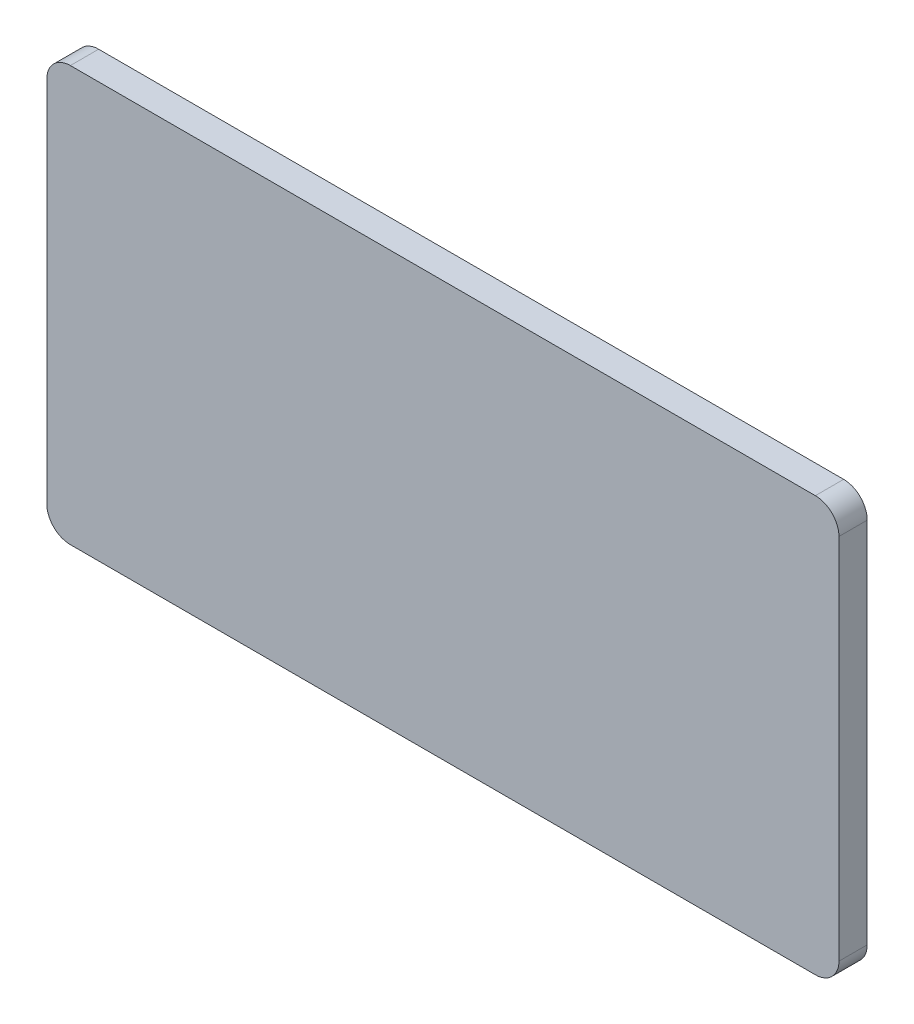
ISO-10303-21;
HEADER;
FILE_DESCRIPTION(('STEP AP214'),'2;1');
FILE_NAME('part.step','',(''),(''),'','','');
FILE_SCHEMA(('AUTOMOTIVE_DESIGN { 1 0 10303 214 1 1 1 1 }'));
ENDSEC;
DATA;
#1=APPLICATION_CONTEXT('core data for automotive mechanical design processes');
#2=APPLICATION_PROTOCOL_DEFINITION('international standard','automotive_design',2000,#1);
#3=PRODUCT_CONTEXT('',#1,'mechanical');
#4=PRODUCT('Part','Part','',(#3));
#5=PRODUCT_RELATED_PRODUCT_CATEGORY('part','',(#4));
#6=PRODUCT_DEFINITION_FORMATION('','',#4);
#7=PRODUCT_DEFINITION_CONTEXT('part definition',#1,'design');
#8=PRODUCT_DEFINITION('design','',#6,#7);
#9=PRODUCT_DEFINITION_SHAPE('','',#8);
#10=(LENGTH_UNIT() NAMED_UNIT(*) SI_UNIT(.MILLI.,.METRE.));
#11=(NAMED_UNIT(*) PLANE_ANGLE_UNIT() SI_UNIT($,.RADIAN.));
#12=(NAMED_UNIT(*) SI_UNIT($,.STERADIAN.) SOLID_ANGLE_UNIT());
#13=UNCERTAINTY_MEASURE_WITH_UNIT(LENGTH_MEASURE(1.E-05),#10,'distance_accuracy_value','');
#14=(GEOMETRIC_REPRESENTATION_CONTEXT(3) GLOBAL_UNCERTAINTY_ASSIGNED_CONTEXT((#13)) GLOBAL_UNIT_ASSIGNED_CONTEXT((#10,
#11,#12)) REPRESENTATION_CONTEXT('',''));
#15=CARTESIAN_POINT('',(0.,0.,0.));
#16=DIRECTION('',(0.,0.,1.));
#17=DIRECTION('',(1.,0.,0.));
#18=AXIS2_PLACEMENT_3D('',#15,#16,#17);
#19=CARTESIAN_POINT('',(-39.5,104.5,0.));
#20=DIRECTION('',(0.,0.,-1.));
#21=DIRECTION('',(-1.,0.,0.));
#22=AXIS2_PLACEMENT_3D('',#19,#20,#21);
#23=PLANE('',#22);
#24=CARTESIAN_POINT('',(-39.5,104.5,0.));
#25=DIRECTION('',(0.,0.,1.));
#26=DIRECTION('',(-1.,0.,0.));
#27=AXIS2_PLACEMENT_3D('',#24,#25,#26);
#28=CIRCLE('',#27,2.5);
#29=CARTESIAN_POINT('',(-39.5,107.,0.));
#30=VERTEX_POINT('',#29);
#31=CARTESIAN_POINT('',(-42.,104.5,0.));
#32=VERTEX_POINT('',#31);
#33=EDGE_CURVE('E146',#30,#32,#28,.T.);
#34=ORIENTED_EDGE('',*,*,#33,.F.);
#35=DIRECTION('',(-1.,0.,0.));
#36=VECTOR('',#35,1.);
#37=CARTESIAN_POINT('',(-39.5,107.,0.));
#38=LINE('',#37,#36);
#39=CARTESIAN_POINT('',(39.5,107.,0.));
#40=VERTEX_POINT('',#39);
#41=EDGE_CURVE('E94',#40,#30,#38,.T.);
#42=ORIENTED_EDGE('',*,*,#41,.F.);
#43=CARTESIAN_POINT('',(39.5,104.5,0.));
#44=DIRECTION('',(0.,0.,1.));
#45=DIRECTION('',(1.,0.,0.));
#46=AXIS2_PLACEMENT_3D('',#43,#44,#45);
#47=CIRCLE('',#46,2.5);
#48=CARTESIAN_POINT('',(42.,104.5,0.));
#49=VERTEX_POINT('',#48);
#50=EDGE_CURVE('E159',#49,#40,#47,.T.);
#51=ORIENTED_EDGE('',*,*,#50,.F.);
#52=DIRECTION('',(0.,1.,0.));
#53=VECTOR('',#52,1.);
#54=CARTESIAN_POINT('',(42.,104.5,0.));
#55=LINE('',#54,#53);
#56=CARTESIAN_POINT('',(42.,65.5,0.));
#57=VERTEX_POINT('',#56);
#58=EDGE_CURVE('E134',#57,#49,#55,.T.);
#59=ORIENTED_EDGE('',*,*,#58,.F.);
#60=CARTESIAN_POINT('',(39.5,65.5,0.));
#61=DIRECTION('',(0.,0.,1.));
#62=DIRECTION('',(1.,0.,0.));
#63=AXIS2_PLACEMENT_3D('',#60,#61,#62);
#64=CIRCLE('',#63,2.5);
#65=CARTESIAN_POINT('',(39.5,63.,0.));
#66=VERTEX_POINT('',#65);
#67=EDGE_CURVE('E156',#66,#57,#64,.T.);
#68=ORIENTED_EDGE('',*,*,#67,.F.);
#69=DIRECTION('',(1.,0.,0.));
#70=VECTOR('',#69,1.);
#71=CARTESIAN_POINT('',(-39.5,63.,0.));
#72=LINE('',#71,#70);
#73=CARTESIAN_POINT('',(-39.5,63.,0.));
#74=VERTEX_POINT('',#73);
#75=EDGE_CURVE('E154',#74,#66,#72,.T.);
#76=ORIENTED_EDGE('',*,*,#75,.F.);
#77=CARTESIAN_POINT('',(-39.5,65.5,0.));
#78=DIRECTION('',(0.,0.,1.));
#79=DIRECTION('',(1.,0.,0.));
#80=AXIS2_PLACEMENT_3D('',#77,#78,#79);
#81=CIRCLE('',#80,2.5);
#82=CARTESIAN_POINT('',(-42.,65.5,0.));
#83=VERTEX_POINT('',#82);
#84=EDGE_CURVE('E152',#83,#74,#81,.T.);
#85=ORIENTED_EDGE('',*,*,#84,.F.);
#86=DIRECTION('',(0.,-1.,0.));
#87=VECTOR('',#86,1.);
#88=CARTESIAN_POINT('',(-42.,104.5,0.));
#89=LINE('',#88,#87);
#90=EDGE_CURVE('E149',#32,#83,#89,.T.);
#91=ORIENTED_EDGE('',*,*,#90,.F.);
#92=EDGE_LOOP('',(#34,#42,#51,#59,#68,#76,#85,#91));
#93=FACE_BOUND('',#92,.T.);
#94=DIRECTION('',(1.,0.,0.));
#95=VECTOR('',#94,1.);
#96=CARTESIAN_POINT('',(33.9,100.4,0.));
#97=LINE('',#96,#95);
#98=CARTESIAN_POINT('',(-33.9,100.4,0.));
#99=VERTEX_POINT('',#98);
#100=CARTESIAN_POINT('',(33.9,100.4,0.));
#101=VERTEX_POINT('',#100);
#102=EDGE_CURVE('E234',#99,#101,#97,.T.);
#103=ORIENTED_EDGE('',*,*,#102,.F.);
#104=CARTESIAN_POINT('',(-33.9,97.9,0.));
#105=DIRECTION('',(0.,0.,-1.));
#106=DIRECTION('',(1.,0.,0.));
#107=AXIS2_PLACEMENT_3D('',#104,#105,#106);
#108=CIRCLE('',#107,2.5);
#109=CARTESIAN_POINT('',(-36.4,97.9,0.));
#110=VERTEX_POINT('',#109);
#111=EDGE_CURVE('E237',#110,#99,#108,.T.);
#112=ORIENTED_EDGE('',*,*,#111,.F.);
#113=DIRECTION('',(0.,1.,0.));
#114=VECTOR('',#113,1.);
#115=CARTESIAN_POINT('',(-36.4,97.9,0.));
#116=LINE('',#115,#114);
#117=CARTESIAN_POINT('',(-36.4,76.9,0.));
#118=VERTEX_POINT('',#117);
#119=EDGE_CURVE('E217',#118,#110,#116,.T.);
#120=ORIENTED_EDGE('',*,*,#119,.F.);
#121=CARTESIAN_POINT('',(-33.9,76.9,0.));
#122=DIRECTION('',(0.,0.,-1.));
#123=DIRECTION('',(-1.,0.,0.));
#124=AXIS2_PLACEMENT_3D('',#121,#122,#123);
#125=CIRCLE('',#124,2.5);
#126=CARTESIAN_POINT('',(-33.9,74.4,0.));
#127=VERTEX_POINT('',#126);
#128=EDGE_CURVE('E220',#127,#118,#125,.T.);
#129=ORIENTED_EDGE('',*,*,#128,.F.);
#130=DIRECTION('',(-1.,0.,0.));
#131=VECTOR('',#130,1.);
#132=CARTESIAN_POINT('',(33.9,74.4,0.));
#133=LINE('',#132,#131);
#134=CARTESIAN_POINT('',(33.9,74.4,0.));
#135=VERTEX_POINT('',#134);
#136=EDGE_CURVE('E222',#135,#127,#133,.T.);
#137=ORIENTED_EDGE('',*,*,#136,.F.);
#138=CARTESIAN_POINT('',(33.9,76.9,0.));
#139=DIRECTION('',(0.,0.,-1.));
#140=DIRECTION('',(-1.,0.,0.));
#141=AXIS2_PLACEMENT_3D('',#138,#139,#140);
#142=CIRCLE('',#141,2.5);
#143=CARTESIAN_POINT('',(36.4,76.9,0.));
#144=VERTEX_POINT('',#143);
#145=EDGE_CURVE('E225',#144,#135,#142,.T.);
#146=ORIENTED_EDGE('',*,*,#145,.F.);
#147=DIRECTION('',(0.,-1.,0.));
#148=VECTOR('',#147,1.);
#149=CARTESIAN_POINT('',(36.4,97.9,0.));
#150=LINE('',#149,#148);
#151=CARTESIAN_POINT('',(36.4,97.9,0.));
#152=VERTEX_POINT('',#151);
#153=EDGE_CURVE('E228',#152,#144,#150,.T.);
#154=ORIENTED_EDGE('',*,*,#153,.F.);
#155=CARTESIAN_POINT('',(33.9,97.9,0.));
#156=DIRECTION('',(0.,0.,-1.));
#157=DIRECTION('',(-1.,0.,0.));
#158=AXIS2_PLACEMENT_3D('',#155,#156,#157);
#159=CIRCLE('',#158,2.5);
#160=EDGE_CURVE('E231',#101,#152,#159,.T.);
#161=ORIENTED_EDGE('',*,*,#160,.F.);
#162=EDGE_LOOP('',(#103,#112,#120,#129,#137,#146,#154,#161));
#163=FACE_BOUND('',#162,.T.);
#164=ADVANCED_FACE('F37',(#93,#163),#23,.T.);
#165=CARTESIAN_POINT('',(-39.5,104.5,3.));
#166=DIRECTION('',(0.,0.,-1.));
#167=DIRECTION('',(-1.,0.,0.));
#168=AXIS2_PLACEMENT_3D('',#165,#166,#167);
#169=CYLINDRICAL_SURFACE('',#168,2.5);
#170=ORIENTED_EDGE('',*,*,#33,.T.);
#171=DIRECTION('',(0.,0.,-1.));
#172=VECTOR('',#171,1.);
#173=CARTESIAN_POINT('',(-42.,104.5,3.));
#174=LINE('',#173,#172);
#175=CARTESIAN_POINT('',(-42.,104.5,3.));
#176=VERTEX_POINT('',#175);
#177=EDGE_CURVE('E11',#176,#32,#174,.T.);
#178=ORIENTED_EDGE('',*,*,#177,.F.);
#179=CARTESIAN_POINT('',(-39.5,104.5,3.));
#180=DIRECTION('',(0.,0.,1.));
#181=DIRECTION('',(-1.,0.,0.));
#182=AXIS2_PLACEMENT_3D('',#179,#180,#181);
#183=CIRCLE('',#182,2.5);
#184=CARTESIAN_POINT('',(-39.5,107.,3.));
#185=VERTEX_POINT('',#184);
#186=EDGE_CURVE('E162',#185,#176,#183,.T.);
#187=ORIENTED_EDGE('',*,*,#186,.F.);
#188=DIRECTION('',(0.,0.,-1.));
#189=VECTOR('',#188,1.);
#190=CARTESIAN_POINT('',(-39.5,107.,3.));
#191=LINE('',#190,#189);
#192=EDGE_CURVE('E142',#185,#30,#191,.T.);
#193=ORIENTED_EDGE('',*,*,#192,.T.);
#194=EDGE_LOOP('',(#170,#178,#187,#193));
#195=FACE_BOUND('',#194,.T.);
#196=ADVANCED_FACE('F39',(#195),#169,.T.);
#197=CARTESIAN_POINT('',(-42.,104.5,3.));
#198=DIRECTION('',(1.,0.,0.));
#199=DIRECTION('',(0.,1.,0.));
#200=AXIS2_PLACEMENT_3D('',#197,#198,#199);
#201=PLANE('',#200);
#202=ORIENTED_EDGE('',*,*,#90,.T.);
#203=DIRECTION('',(0.,0.,-1.));
#204=VECTOR('',#203,1.);
#205=CARTESIAN_POINT('',(-42.,65.5,3.));
#206=LINE('',#205,#204);
#207=CARTESIAN_POINT('',(-42.,65.5,3.));
#208=VERTEX_POINT('',#207);
#209=EDGE_CURVE('E45',#208,#83,#206,.T.);
#210=ORIENTED_EDGE('',*,*,#209,.F.);
#211=DIRECTION('',(0.,-1.,0.));
#212=VECTOR('',#211,1.);
#213=CARTESIAN_POINT('',(-42.,104.5,3.));
#214=LINE('',#213,#212);
#215=EDGE_CURVE('E102',#176,#208,#214,.T.);
#216=ORIENTED_EDGE('',*,*,#215,.F.);
#217=ORIENTED_EDGE('',*,*,#177,.T.);
#218=EDGE_LOOP('',(#202,#210,#216,#217));
#219=FACE_BOUND('',#218,.T.);
#220=ADVANCED_FACE('F339',(#219),#201,.F.);
#221=CARTESIAN_POINT('',(-39.5,65.5,3.));
#222=DIRECTION('',(0.,0.,-1.));
#223=DIRECTION('',(-1.,0.,0.));
#224=AXIS2_PLACEMENT_3D('',#221,#222,#223);
#225=CYLINDRICAL_SURFACE('',#224,2.5);
#226=ORIENTED_EDGE('',*,*,#84,.T.);
#227=DIRECTION('',(0.,0.,-1.));
#228=VECTOR('',#227,1.);
#229=CARTESIAN_POINT('',(-39.5,63.,3.));
#230=LINE('',#229,#228);
#231=CARTESIAN_POINT('',(-39.5,63.,3.));
#232=VERTEX_POINT('',#231);
#233=EDGE_CURVE('E169',#232,#74,#230,.T.);
#234=ORIENTED_EDGE('',*,*,#233,.F.);
#235=CARTESIAN_POINT('',(-39.5,65.5,3.));
#236=DIRECTION('',(0.,0.,1.));
#237=DIRECTION('',(1.,0.,0.));
#238=AXIS2_PLACEMENT_3D('',#235,#236,#237);
#239=CIRCLE('',#238,2.5);
#240=EDGE_CURVE('E177',#208,#232,#239,.T.);
#241=ORIENTED_EDGE('',*,*,#240,.F.);
#242=ORIENTED_EDGE('',*,*,#209,.T.);
#243=EDGE_LOOP('',(#226,#234,#241,#242));
#244=FACE_BOUND('',#243,.T.);
#245=ADVANCED_FACE('F175',(#244),#225,.T.);
#246=CARTESIAN_POINT('',(-39.5,63.,3.));
#247=DIRECTION('',(0.,1.,0.));
#248=DIRECTION('',(0.,0.,1.));
#249=AXIS2_PLACEMENT_3D('',#246,#247,#248);
#250=PLANE('',#249);
#251=ORIENTED_EDGE('',*,*,#75,.T.);
#252=DIRECTION('',(0.,0.,-1.));
#253=VECTOR('',#252,1.);
#254=CARTESIAN_POINT('',(39.5,63.,3.));
#255=LINE('',#254,#253);
#256=CARTESIAN_POINT('',(39.5,63.,3.));
#257=VERTEX_POINT('',#256);
#258=EDGE_CURVE('E166',#257,#66,#255,.T.);
#259=ORIENTED_EDGE('',*,*,#258,.F.);
#260=DIRECTION('',(1.,0.,0.));
#261=VECTOR('',#260,1.);
#262=CARTESIAN_POINT('',(-39.5,63.,3.));
#263=LINE('',#262,#261);
#264=EDGE_CURVE('E189',#232,#257,#263,.T.);
#265=ORIENTED_EDGE('',*,*,#264,.F.);
#266=ORIENTED_EDGE('',*,*,#233,.T.);
#267=EDGE_LOOP('',(#251,#259,#265,#266));
#268=FACE_BOUND('',#267,.T.);
#269=ADVANCED_FACE('F185',(#268),#250,.F.);
#270=CARTESIAN_POINT('',(39.5,65.5,3.));
#271=DIRECTION('',(0.,0.,-1.));
#272=DIRECTION('',(-1.,0.,0.));
#273=AXIS2_PLACEMENT_3D('',#270,#271,#272);
#274=CYLINDRICAL_SURFACE('',#273,2.5);
#275=ORIENTED_EDGE('',*,*,#67,.T.);
#276=DIRECTION('',(0.,0.,-1.));
#277=VECTOR('',#276,1.);
#278=CARTESIAN_POINT('',(42.,65.5,3.));
#279=LINE('',#278,#277);
#280=CARTESIAN_POINT('',(42.,65.5,3.));
#281=VERTEX_POINT('',#280);
#282=EDGE_CURVE('E137',#281,#57,#279,.T.);
#283=ORIENTED_EDGE('',*,*,#282,.F.);
#284=CARTESIAN_POINT('',(39.5,65.5,3.));
#285=DIRECTION('',(0.,0.,1.));
#286=DIRECTION('',(1.,0.,0.));
#287=AXIS2_PLACEMENT_3D('',#284,#285,#286);
#288=CIRCLE('',#287,2.5);
#289=EDGE_CURVE('E125',#257,#281,#288,.T.);
#290=ORIENTED_EDGE('',*,*,#289,.F.);
#291=ORIENTED_EDGE('',*,*,#258,.T.);
#292=EDGE_LOOP('',(#275,#283,#290,#291));
#293=FACE_BOUND('',#292,.T.);
#294=ADVANCED_FACE('F188',(#293),#274,.T.);
#295=CARTESIAN_POINT('',(42.,104.5,3.));
#296=DIRECTION('',(-1.,0.,0.));
#297=DIRECTION('',(0.,-1.,0.));
#298=AXIS2_PLACEMENT_3D('',#295,#296,#297);
#299=PLANE('',#298);
#300=ORIENTED_EDGE('',*,*,#58,.T.);
#301=DIRECTION('',(0.,0.,-1.));
#302=VECTOR('',#301,1.);
#303=CARTESIAN_POINT('',(42.,104.5,3.));
#304=LINE('',#303,#302);
#305=CARTESIAN_POINT('',(42.,104.5,3.));
#306=VERTEX_POINT('',#305);
#307=EDGE_CURVE('E131',#306,#49,#304,.T.);
#308=ORIENTED_EDGE('',*,*,#307,.F.);
#309=DIRECTION('',(0.,1.,0.));
#310=VECTOR('',#309,1.);
#311=CARTESIAN_POINT('',(42.,104.5,3.));
#312=LINE('',#311,#310);
#313=EDGE_CURVE('E118',#281,#306,#312,.T.);
#314=ORIENTED_EDGE('',*,*,#313,.F.);
#315=ORIENTED_EDGE('',*,*,#282,.T.);
#316=EDGE_LOOP('',(#300,#308,#314,#315));
#317=FACE_BOUND('',#316,.T.);
#318=ADVANCED_FACE('F132',(#317),#299,.F.);
#319=CARTESIAN_POINT('',(39.5,104.5,3.));
#320=DIRECTION('',(0.,0.,-1.));
#321=DIRECTION('',(-1.,0.,0.));
#322=AXIS2_PLACEMENT_3D('',#319,#320,#321);
#323=CYLINDRICAL_SURFACE('',#322,2.5);
#324=ORIENTED_EDGE('',*,*,#50,.T.);
#325=DIRECTION('',(0.,0.,-1.));
#326=VECTOR('',#325,1.);
#327=CARTESIAN_POINT('',(39.5,107.,3.));
#328=LINE('',#327,#326);
#329=CARTESIAN_POINT('',(39.5,107.,3.));
#330=VERTEX_POINT('',#329);
#331=EDGE_CURVE('E138',#330,#40,#328,.T.);
#332=ORIENTED_EDGE('',*,*,#331,.F.);
#333=CARTESIAN_POINT('',(39.5,104.5,3.));
#334=DIRECTION('',(0.,0.,1.));
#335=DIRECTION('',(1.,0.,0.));
#336=AXIS2_PLACEMENT_3D('',#333,#334,#335);
#337=CIRCLE('',#336,2.5);
#338=EDGE_CURVE('E122',#306,#330,#337,.T.);
#339=ORIENTED_EDGE('',*,*,#338,.F.);
#340=ORIENTED_EDGE('',*,*,#307,.T.);
#341=EDGE_LOOP('',(#324,#332,#339,#340));
#342=FACE_BOUND('',#341,.T.);
#343=ADVANCED_FACE('F140',(#342),#323,.T.);
#344=CARTESIAN_POINT('',(-39.5,107.,3.));
#345=DIRECTION('',(0.,-1.,0.));
#346=DIRECTION('',(0.,0.,-1.));
#347=AXIS2_PLACEMENT_3D('',#344,#345,#346);
#348=PLANE('',#347);
#349=ORIENTED_EDGE('',*,*,#41,.T.);
#350=ORIENTED_EDGE('',*,*,#192,.F.);
#351=DIRECTION('',(-1.,0.,0.));
#352=VECTOR('',#351,1.);
#353=CARTESIAN_POINT('',(-39.5,107.,3.));
#354=LINE('',#353,#352);
#355=EDGE_CURVE('E61',#330,#185,#354,.T.);
#356=ORIENTED_EDGE('',*,*,#355,.F.);
#357=ORIENTED_EDGE('',*,*,#331,.T.);
#358=EDGE_LOOP('',(#349,#350,#356,#357));
#359=FACE_BOUND('',#358,.T.);
#360=ADVANCED_FACE('F344',(#359),#348,.F.);
#361=CARTESIAN_POINT('',(-39.5,104.5,3.));
#362=DIRECTION('',(0.,0.,-1.));
#363=DIRECTION('',(-1.,0.,0.));
#364=AXIS2_PLACEMENT_3D('',#361,#362,#363);
#365=PLANE('',#364);
#366=ORIENTED_EDGE('',*,*,#186,.T.);
#367=ORIENTED_EDGE('',*,*,#215,.T.);
#368=ORIENTED_EDGE('',*,*,#240,.T.);
#369=ORIENTED_EDGE('',*,*,#264,.T.);
#370=ORIENTED_EDGE('',*,*,#289,.T.);
#371=ORIENTED_EDGE('',*,*,#313,.T.);
#372=ORIENTED_EDGE('',*,*,#338,.T.);
#373=ORIENTED_EDGE('',*,*,#355,.T.);
#374=EDGE_LOOP('',(#366,#367,#368,#369,#370,#371,#372,#373));
#375=FACE_BOUND('',#374,.T.);
#376=ADVANCED_FACE('F120',(#375),#365,.F.);
#377=CARTESIAN_POINT('',(-33.9,97.9,-3.));
#378=DIRECTION('',(0.,0.,1.));
#379=DIRECTION('',(1.,0.,0.));
#380=AXIS2_PLACEMENT_3D('',#377,#378,#379);
#381=CYLINDRICAL_SURFACE('',#380,2.5);
#382=ORIENTED_EDGE('',*,*,#111,.T.);
#383=DIRECTION('',(0.,0.,1.));
#384=VECTOR('',#383,1.);
#385=CARTESIAN_POINT('',(-33.9,100.4,-3.));
#386=LINE('',#385,#384);
#387=CARTESIAN_POINT('',(-33.9,100.4,-3.));
#388=VERTEX_POINT('',#387);
#389=EDGE_CURVE('E150',#388,#99,#386,.T.);
#390=ORIENTED_EDGE('',*,*,#389,.F.);
#391=CARTESIAN_POINT('',(-33.9,97.9,-3.));
#392=DIRECTION('',(0.,0.,-1.));
#393=DIRECTION('',(1.,0.,0.));
#394=AXIS2_PLACEMENT_3D('',#391,#392,#393);
#395=CIRCLE('',#394,2.5);
#396=CARTESIAN_POINT('',(-36.4,97.9,-3.));
#397=VERTEX_POINT('',#396);
#398=EDGE_CURVE('E219',#397,#388,#395,.T.);
#399=ORIENTED_EDGE('',*,*,#398,.F.);
#400=DIRECTION('',(0.,0.,1.));
#401=VECTOR('',#400,1.);
#402=CARTESIAN_POINT('',(-36.4,97.9,-3.));
#403=LINE('',#402,#401);
#404=EDGE_CURVE('E213',#397,#110,#403,.T.);
#405=ORIENTED_EDGE('',*,*,#404,.T.);
#406=EDGE_LOOP('',(#382,#390,#399,#405));
#407=FACE_BOUND('',#406,.T.);
#408=ADVANCED_FACE('F272',(#407),#381,.T.);
#409=CARTESIAN_POINT('',(33.9,100.4,-3.));
#410=DIRECTION('',(0.,-1.,0.));
#411=DIRECTION('',(0.,0.,-1.));
#412=AXIS2_PLACEMENT_3D('',#409,#410,#411);
#413=PLANE('',#412);
#414=ORIENTED_EDGE('',*,*,#102,.T.);
#415=DIRECTION('',(0.,0.,1.));
#416=VECTOR('',#415,1.);
#417=CARTESIAN_POINT('',(33.9,100.4,-3.));
#418=LINE('',#417,#416);
#419=CARTESIAN_POINT('',(33.9,100.4,-3.));
#420=VERTEX_POINT('',#419);
#421=EDGE_CURVE('E197',#420,#101,#418,.T.);
#422=ORIENTED_EDGE('',*,*,#421,.F.);
#423=DIRECTION('',(1.,0.,0.));
#424=VECTOR('',#423,1.);
#425=CARTESIAN_POINT('',(33.9,100.4,-3.));
#426=LINE('',#425,#424);
#427=EDGE_CURVE('E257',#388,#420,#426,.T.);
#428=ORIENTED_EDGE('',*,*,#427,.F.);
#429=ORIENTED_EDGE('',*,*,#389,.T.);
#430=EDGE_LOOP('',(#414,#422,#428,#429));
#431=FACE_BOUND('',#430,.T.);
#432=ADVANCED_FACE('F277',(#431),#413,.F.);
#433=CARTESIAN_POINT('',(33.9,97.9,-3.));
#434=DIRECTION('',(0.,0.,1.));
#435=DIRECTION('',(1.,0.,0.));
#436=AXIS2_PLACEMENT_3D('',#433,#434,#435);
#437=CYLINDRICAL_SURFACE('',#436,2.5);
#438=ORIENTED_EDGE('',*,*,#160,.T.);
#439=DIRECTION('',(0.,0.,1.));
#440=VECTOR('',#439,1.);
#441=CARTESIAN_POINT('',(36.4,97.9,-3.));
#442=LINE('',#441,#440);
#443=CARTESIAN_POINT('',(36.4,97.9,-3.));
#444=VERTEX_POINT('',#443);
#445=EDGE_CURVE('E200',#444,#152,#442,.T.);
#446=ORIENTED_EDGE('',*,*,#445,.F.);
#447=CARTESIAN_POINT('',(33.9,97.9,-3.));
#448=DIRECTION('',(0.,0.,-1.));
#449=DIRECTION('',(-1.,0.,0.));
#450=AXIS2_PLACEMENT_3D('',#447,#448,#449);
#451=CIRCLE('',#450,2.5);
#452=EDGE_CURVE('E254',#420,#444,#451,.T.);
#453=ORIENTED_EDGE('',*,*,#452,.F.);
#454=ORIENTED_EDGE('',*,*,#421,.T.);
#455=EDGE_LOOP('',(#438,#446,#453,#454));
#456=FACE_BOUND('',#455,.T.);
#457=ADVANCED_FACE('F301',(#456),#437,.T.);
#458=CARTESIAN_POINT('',(36.4,97.9,-3.));
#459=DIRECTION('',(-1.,0.,0.));
#460=DIRECTION('',(0.,0.,1.));
#461=AXIS2_PLACEMENT_3D('',#458,#459,#460);
#462=PLANE('',#461);
#463=ORIENTED_EDGE('',*,*,#153,.T.);
#464=DIRECTION('',(0.,0.,1.));
#465=VECTOR('',#464,1.);
#466=CARTESIAN_POINT('',(36.4,76.9,-3.));
#467=LINE('',#466,#465);
#468=CARTESIAN_POINT('',(36.4,76.9,-3.));
#469=VERTEX_POINT('',#468);
#470=EDGE_CURVE('E203',#469,#144,#467,.T.);
#471=ORIENTED_EDGE('',*,*,#470,.F.);
#472=DIRECTION('',(0.,-1.,0.));
#473=VECTOR('',#472,1.);
#474=CARTESIAN_POINT('',(36.4,97.9,-3.));
#475=LINE('',#474,#473);
#476=EDGE_CURVE('E251',#444,#469,#475,.T.);
#477=ORIENTED_EDGE('',*,*,#476,.F.);
#478=ORIENTED_EDGE('',*,*,#445,.T.);
#479=EDGE_LOOP('',(#463,#471,#477,#478));
#480=FACE_BOUND('',#479,.T.);
#481=ADVANCED_FACE('F306',(#480),#462,.F.);
#482=CARTESIAN_POINT('',(33.9,76.9,-3.));
#483=DIRECTION('',(0.,0.,1.));
#484=DIRECTION('',(1.,0.,0.));
#485=AXIS2_PLACEMENT_3D('',#482,#483,#484);
#486=CYLINDRICAL_SURFACE('',#485,2.5);
#487=ORIENTED_EDGE('',*,*,#145,.T.);
#488=DIRECTION('',(0.,0.,1.));
#489=VECTOR('',#488,1.);
#490=CARTESIAN_POINT('',(33.9,74.4,-3.));
#491=LINE('',#490,#489);
#492=CARTESIAN_POINT('',(33.9,74.4,-3.));
#493=VERTEX_POINT('',#492);
#494=EDGE_CURVE('E206',#493,#135,#491,.T.);
#495=ORIENTED_EDGE('',*,*,#494,.F.);
#496=CARTESIAN_POINT('',(33.9,76.9,-3.));
#497=DIRECTION('',(0.,0.,-1.));
#498=DIRECTION('',(-1.,0.,0.));
#499=AXIS2_PLACEMENT_3D('',#496,#497,#498);
#500=CIRCLE('',#499,2.5);
#501=EDGE_CURVE('E248',#469,#493,#500,.T.);
#502=ORIENTED_EDGE('',*,*,#501,.F.);
#503=ORIENTED_EDGE('',*,*,#470,.T.);
#504=EDGE_LOOP('',(#487,#495,#502,#503));
#505=FACE_BOUND('',#504,.T.);
#506=ADVANCED_FACE('F324',(#505),#486,.T.);
#507=CARTESIAN_POINT('',(33.9,74.4,-3.));
#508=DIRECTION('',(0.,1.,0.));
#509=DIRECTION('',(0.,0.,1.));
#510=AXIS2_PLACEMENT_3D('',#507,#508,#509);
#511=PLANE('',#510);
#512=ORIENTED_EDGE('',*,*,#136,.T.);
#513=DIRECTION('',(0.,0.,1.));
#514=VECTOR('',#513,1.);
#515=CARTESIAN_POINT('',(-33.9,74.4,-3.));
#516=LINE('',#515,#514);
#517=CARTESIAN_POINT('',(-33.9,74.4,-3.));
#518=VERTEX_POINT('',#517);
#519=EDGE_CURVE('E209',#518,#127,#516,.T.);
#520=ORIENTED_EDGE('',*,*,#519,.F.);
#521=DIRECTION('',(-1.,0.,0.));
#522=VECTOR('',#521,1.);
#523=CARTESIAN_POINT('',(33.9,74.4,-3.));
#524=LINE('',#523,#522);
#525=EDGE_CURVE('E245',#493,#518,#524,.T.);
#526=ORIENTED_EDGE('',*,*,#525,.F.);
#527=ORIENTED_EDGE('',*,*,#494,.T.);
#528=EDGE_LOOP('',(#512,#520,#526,#527));
#529=FACE_BOUND('',#528,.T.);
#530=ADVANCED_FACE('F325',(#529),#511,.F.);
#531=CARTESIAN_POINT('',(-33.9,76.9,-3.));
#532=DIRECTION('',(0.,0.,1.));
#533=DIRECTION('',(1.,0.,0.));
#534=AXIS2_PLACEMENT_3D('',#531,#532,#533);
#535=CYLINDRICAL_SURFACE('',#534,2.5);
#536=ORIENTED_EDGE('',*,*,#128,.T.);
#537=DIRECTION('',(0.,0.,1.));
#538=VECTOR('',#537,1.);
#539=CARTESIAN_POINT('',(-36.4,76.9,-3.));
#540=LINE('',#539,#538);
#541=CARTESIAN_POINT('',(-36.4,76.9,-3.));
#542=VERTEX_POINT('',#541);
#543=EDGE_CURVE('E52',#542,#118,#540,.T.);
#544=ORIENTED_EDGE('',*,*,#543,.F.);
#545=CARTESIAN_POINT('',(-33.9,76.9,-3.));
#546=DIRECTION('',(0.,0.,-1.));
#547=DIRECTION('',(-1.,0.,0.));
#548=AXIS2_PLACEMENT_3D('',#545,#546,#547);
#549=CIRCLE('',#548,2.5);
#550=EDGE_CURVE('E242',#518,#542,#549,.T.);
#551=ORIENTED_EDGE('',*,*,#550,.F.);
#552=ORIENTED_EDGE('',*,*,#519,.T.);
#553=EDGE_LOOP('',(#536,#544,#551,#552));
#554=FACE_BOUND('',#553,.T.);
#555=ADVANCED_FACE('F322',(#554),#535,.T.);
#556=CARTESIAN_POINT('',(-36.4,97.9,-3.));
#557=DIRECTION('',(1.,0.,0.));
#558=DIRECTION('',(0.,0.,-1.));
#559=AXIS2_PLACEMENT_3D('',#556,#557,#558);
#560=PLANE('',#559);
#561=ORIENTED_EDGE('',*,*,#119,.T.);
#562=ORIENTED_EDGE('',*,*,#404,.F.);
#563=DIRECTION('',(0.,1.,0.));
#564=VECTOR('',#563,1.);
#565=CARTESIAN_POINT('',(-36.4,97.9,-3.));
#566=LINE('',#565,#564);
#567=EDGE_CURVE('E216',#542,#397,#566,.T.);
#568=ORIENTED_EDGE('',*,*,#567,.F.);
#569=ORIENTED_EDGE('',*,*,#543,.T.);
#570=EDGE_LOOP('',(#561,#562,#568,#569));
#571=FACE_BOUND('',#570,.T.);
#572=ADVANCED_FACE('F294',(#571),#560,.F.);
#573=CARTESIAN_POINT('',(-33.9,97.9,-3.));
#574=DIRECTION('',(0.,0.,1.));
#575=DIRECTION('',(1.,0.,0.));
#576=AXIS2_PLACEMENT_3D('',#573,#574,#575);
#577=PLANE('',#576);
#578=ORIENTED_EDGE('',*,*,#398,.T.);
#579=ORIENTED_EDGE('',*,*,#427,.T.);
#580=ORIENTED_EDGE('',*,*,#452,.T.);
#581=ORIENTED_EDGE('',*,*,#476,.T.);
#582=ORIENTED_EDGE('',*,*,#501,.T.);
#583=ORIENTED_EDGE('',*,*,#525,.T.);
#584=ORIENTED_EDGE('',*,*,#550,.T.);
#585=ORIENTED_EDGE('',*,*,#567,.T.);
#586=EDGE_LOOP('',(#578,#579,#580,#581,#582,#583,#584,#585));
#587=FACE_BOUND('',#586,.T.);
#588=ADVANCED_FACE('F265',(#587),#577,.F.);
#589=CLOSED_SHELL('',(#164,#196,#220,#245,#269,#294,#318,#343,#360,#376,#408,#432,#457,#481,
#506,#530,#555,#572,#588));
#590=MANIFOLD_SOLID_BREP('B2',#589);
#591=ADVANCED_BREP_SHAPE_REPRESENTATION('',(#18,#590),#14);
#592=SHAPE_DEFINITION_REPRESENTATION(#9,#591);
ENDSEC;
END-ISO-10303-21;
